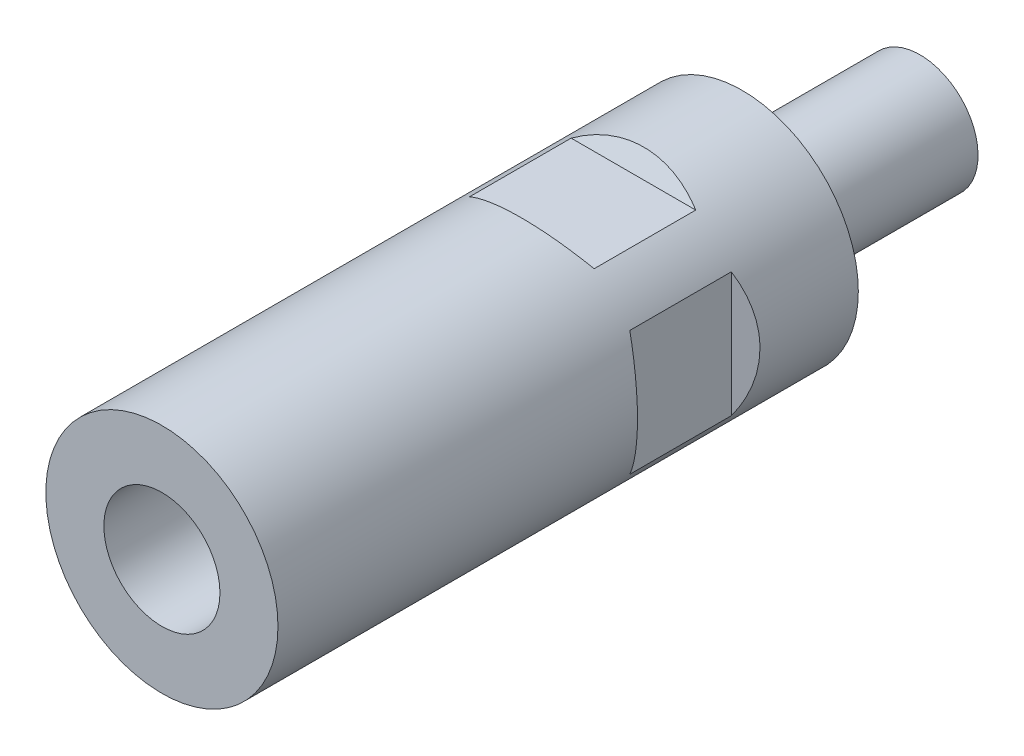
ISO-10303-21;
HEADER;
FILE_DESCRIPTION(('STEP AP214'),'2;1');
FILE_NAME('part.step','',(''),(''),'','','');
FILE_SCHEMA(('AUTOMOTIVE_DESIGN { 1 0 10303 214 1 1 1 1 }'));
ENDSEC;
DATA;
#1=APPLICATION_CONTEXT('core data for automotive mechanical design processes');
#2=APPLICATION_PROTOCOL_DEFINITION('international standard','automotive_design',2000,#1);
#3=PRODUCT_CONTEXT('',#1,'mechanical');
#4=PRODUCT('Part','Part','',(#3));
#5=PRODUCT_RELATED_PRODUCT_CATEGORY('part','',(#4));
#6=PRODUCT_DEFINITION_FORMATION('','',#4);
#7=PRODUCT_DEFINITION_CONTEXT('part definition',#1,'design');
#8=PRODUCT_DEFINITION('design','',#6,#7);
#9=PRODUCT_DEFINITION_SHAPE('','',#8);
#10=(LENGTH_UNIT() NAMED_UNIT(*) SI_UNIT(.MILLI.,.METRE.));
#11=(NAMED_UNIT(*) PLANE_ANGLE_UNIT() SI_UNIT($,.RADIAN.));
#12=(NAMED_UNIT(*) SI_UNIT($,.STERADIAN.) SOLID_ANGLE_UNIT());
#13=UNCERTAINTY_MEASURE_WITH_UNIT(LENGTH_MEASURE(1.E-05),#10,'distance_accuracy_value','');
#14=(GEOMETRIC_REPRESENTATION_CONTEXT(3) GLOBAL_UNCERTAINTY_ASSIGNED_CONTEXT((#13)) GLOBAL_UNIT_ASSIGNED_CONTEXT((#10,
#11,#12)) REPRESENTATION_CONTEXT('',''));
#15=CARTESIAN_POINT('',(0.,0.,0.));
#16=DIRECTION('',(0.,0.,1.));
#17=DIRECTION('',(1.,0.,0.));
#18=AXIS2_PLACEMENT_3D('',#15,#16,#17);
#19=CARTESIAN_POINT('',(0.,0.,0.));
#20=DIRECTION('',(0.,0.,1.));
#21=DIRECTION('',(1.,0.,0.));
#22=AXIS2_PLACEMENT_3D('',#19,#20,#21);
#23=PLANE('',#22);
#24=CARTESIAN_POINT('',(0.,0.,0.));
#25=DIRECTION('',(0.,0.,1.));
#26=DIRECTION('',(1.,0.,0.));
#27=AXIS2_PLACEMENT_3D('',#24,#25,#26);
#28=CIRCLE('',#27,16.);
#29=CARTESIAN_POINT('',(16.,0.,0.));
#30=VERTEX_POINT('',#29);
#31=EDGE_CURVE('E134',#30,#30,#28,.T.);
#32=ORIENTED_EDGE('',*,*,#31,.F.);
#33=EDGE_LOOP('',(#32));
#34=FACE_BOUND('',#33,.T.);
#35=CARTESIAN_POINT('',(0.,0.,0.));
#36=DIRECTION('',(0.,0.,1.));
#37=DIRECTION('',(1.,0.,0.));
#38=AXIS2_PLACEMENT_3D('',#35,#36,#37);
#39=CIRCLE('',#38,8.);
#40=CARTESIAN_POINT('',(8.,0.,0.));
#41=VERTEX_POINT('',#40);
#42=EDGE_CURVE('E9',#41,#41,#39,.F.);
#43=ORIENTED_EDGE('',*,*,#42,.F.);
#44=EDGE_LOOP('',(#43));
#45=FACE_BOUND('',#44,.T.);
#46=ADVANCED_FACE('F14',(#34,#45),#23,.F.);
#47=CARTESIAN_POINT('',(0.,0.,80.));
#48=DIRECTION('',(0.,0.,-1.));
#49=DIRECTION('',(-1.,0.,0.));
#50=AXIS2_PLACEMENT_3D('',#47,#48,#49);
#51=CYLINDRICAL_SURFACE('',#50,16.);
#52=DIRECTION('',(0.,0.,-1.));
#53=VECTOR('',#52,1.);
#54=CARTESIAN_POINT('',(-8.58778201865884,-13.5,80.));
#55=LINE('',#54,#53);
#56=CARTESIAN_POINT('',(-8.58778201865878,-13.5,15.));
#57=VERTEX_POINT('',#56);
#58=CARTESIAN_POINT('',(-8.58778201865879,-13.5,29.));
#59=VERTEX_POINT('',#58);
#60=EDGE_CURVE('E87',#57,#59,#55,.F.);
#61=ORIENTED_EDGE('',*,*,#60,.T.);
#62=CARTESIAN_POINT('',(0.,0.,21.2057713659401));
#63=DIRECTION('',(0.,0.5,0.86602540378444));
#64=DIRECTION('',(0.,0.86602540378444,-0.5));
#65=AXIS2_PLACEMENT_3D('',#62,#63,#64);
#66=ELLIPSE('',#65,18.475208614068,16.);
#67=CARTESIAN_POINT('',(8.58778201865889,-13.5,29.));
#68=VERTEX_POINT('',#67);
#69=EDGE_CURVE('E22',#59,#68,#66,.T.);
#70=ORIENTED_EDGE('',*,*,#69,.T.);
#71=DIRECTION('',(0.,0.,-1.));
#72=VECTOR('',#71,1.);
#73=CARTESIAN_POINT('',(8.58778201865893,-13.5,80.));
#74=LINE('',#73,#72);
#75=CARTESIAN_POINT('',(8.58778201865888,-13.5,15.));
#76=VERTEX_POINT('',#75);
#77=EDGE_CURVE('E93',#68,#76,#74,.T.);
#78=ORIENTED_EDGE('',*,*,#77,.T.);
#79=CARTESIAN_POINT('',(0.,0.,22.7942286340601));
#80=DIRECTION('',(0.,0.5,-0.866025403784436));
#81=DIRECTION('',(0.,-0.866025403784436,-0.5));
#82=AXIS2_PLACEMENT_3D('',#79,#80,#81);
#83=ELLIPSE('',#82,18.4752086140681,16.);
#84=EDGE_CURVE('E79',#76,#57,#83,.T.);
#85=ORIENTED_EDGE('',*,*,#84,.T.);
#86=EDGE_LOOP('',(#61,#70,#78,#85));
#87=FACE_BOUND('',#86,.T.);
#88=CARTESIAN_POINT('',(0.,0.,22.7942286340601));
#89=DIRECTION('',(0.,-0.5,-0.866025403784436));
#90=DIRECTION('',(0.,0.866025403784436,-0.5));
#91=AXIS2_PLACEMENT_3D('',#88,#89,#90);
#92=ELLIPSE('',#91,18.4752086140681,16.);
#93=CARTESIAN_POINT('',(-8.58778201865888,13.5,15.));
#94=VERTEX_POINT('',#93);
#95=CARTESIAN_POINT('',(8.58778201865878,13.5,15.));
#96=VERTEX_POINT('',#95);
#97=EDGE_CURVE('E111',#94,#96,#92,.T.);
#98=ORIENTED_EDGE('',*,*,#97,.T.);
#99=DIRECTION('',(0.,0.,-1.));
#100=VECTOR('',#99,1.);
#101=CARTESIAN_POINT('',(8.5877820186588,13.5,80.));
#102=LINE('',#101,#100);
#103=CARTESIAN_POINT('',(8.5877820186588,13.5,29.));
#104=VERTEX_POINT('',#103);
#105=EDGE_CURVE('E88',#96,#104,#102,.F.);
#106=ORIENTED_EDGE('',*,*,#105,.T.);
#107=CARTESIAN_POINT('',(0.,0.,21.2057713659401));
#108=DIRECTION('',(0.,-0.5,0.86602540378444));
#109=DIRECTION('',(0.,-0.86602540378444,-0.5));
#110=AXIS2_PLACEMENT_3D('',#107,#108,#109);
#111=ELLIPSE('',#110,18.475208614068,16.);
#112=CARTESIAN_POINT('',(-8.5877820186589,13.5,29.));
#113=VERTEX_POINT('',#112);
#114=EDGE_CURVE('E105',#104,#113,#111,.T.);
#115=ORIENTED_EDGE('',*,*,#114,.T.);
#116=DIRECTION('',(0.,0.,-1.));
#117=VECTOR('',#116,1.);
#118=CARTESIAN_POINT('',(-8.5877820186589,13.5,80.));
#119=LINE('',#118,#117);
#120=EDGE_CURVE('E108',#113,#94,#119,.T.);
#121=ORIENTED_EDGE('',*,*,#120,.T.);
#122=EDGE_LOOP('',(#98,#106,#115,#121));
#123=FACE_BOUND('',#122,.T.);
#124=DIRECTION('',(0.,0.,-1.));
#125=VECTOR('',#124,1.);
#126=CARTESIAN_POINT('',(-13.5,8.58778201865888,80.));
#127=LINE('',#126,#125);
#128=CARTESIAN_POINT('',(-13.5,8.58778201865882,15.));
#129=VERTEX_POINT('',#128);
#130=CARTESIAN_POINT('',(-13.5,8.58778201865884,29.));
#131=VERTEX_POINT('',#130);
#132=EDGE_CURVE('E119',#129,#131,#127,.F.);
#133=ORIENTED_EDGE('',*,*,#132,.T.);
#134=CARTESIAN_POINT('',(0.,0.,21.2057713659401));
#135=DIRECTION('',(0.5,0.,0.86602540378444));
#136=DIRECTION('',(0.86602540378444,0.,-0.5));
#137=AXIS2_PLACEMENT_3D('',#134,#135,#136);
#138=ELLIPSE('',#137,18.475208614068,16.);
#139=CARTESIAN_POINT('',(-13.5,-8.58778201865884,29.));
#140=VERTEX_POINT('',#139);
#141=EDGE_CURVE('E113',#131,#140,#138,.T.);
#142=ORIENTED_EDGE('',*,*,#141,.T.);
#143=DIRECTION('',(0.,0.,-1.));
#144=VECTOR('',#143,1.);
#145=CARTESIAN_POINT('',(-13.5,-8.58778201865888,80.));
#146=LINE('',#145,#144);
#147=CARTESIAN_POINT('',(-13.5,-8.58778201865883,15.));
#148=VERTEX_POINT('',#147);
#149=EDGE_CURVE('E116',#140,#148,#146,.T.);
#150=ORIENTED_EDGE('',*,*,#149,.T.);
#151=CARTESIAN_POINT('',(0.,0.,22.7942286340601));
#152=DIRECTION('',(0.5,0.,-0.866025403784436));
#153=DIRECTION('',(-0.866025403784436,0.,-0.5));
#154=AXIS2_PLACEMENT_3D('',#151,#152,#153);
#155=ELLIPSE('',#154,18.4752086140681,16.);
#156=EDGE_CURVE('E122',#148,#129,#155,.T.);
#157=ORIENTED_EDGE('',*,*,#156,.T.);
#158=EDGE_LOOP('',(#133,#142,#150,#157));
#159=FACE_BOUND('',#158,.T.);
#160=CARTESIAN_POINT('',(0.,0.,22.7942286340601));
#161=DIRECTION('',(-0.5,0.,-0.866025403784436));
#162=DIRECTION('',(0.866025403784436,0.,-0.5));
#163=AXIS2_PLACEMENT_3D('',#160,#161,#162);
#164=ELLIPSE('',#163,18.4752086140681,16.);
#165=CARTESIAN_POINT('',(13.5,8.58778201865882,15.));
#166=VERTEX_POINT('',#165);
#167=CARTESIAN_POINT('',(13.5,-8.58778201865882,15.));
#168=VERTEX_POINT('',#167);
#169=EDGE_CURVE('E129',#166,#168,#164,.T.);
#170=ORIENTED_EDGE('',*,*,#169,.T.);
#171=DIRECTION('',(0.,0.,-1.));
#172=VECTOR('',#171,1.);
#173=CARTESIAN_POINT('',(13.5,-8.58778201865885,80.));
#174=LINE('',#173,#172);
#175=CARTESIAN_POINT('',(13.5,-8.58778201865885,29.));
#176=VERTEX_POINT('',#175);
#177=EDGE_CURVE('E124',#168,#176,#174,.F.);
#178=ORIENTED_EDGE('',*,*,#177,.T.);
#179=CARTESIAN_POINT('',(0.,0.,21.2057713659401));
#180=DIRECTION('',(-0.5,0.,0.86602540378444));
#181=DIRECTION('',(-0.86602540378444,0.,-0.5));
#182=AXIS2_PLACEMENT_3D('',#179,#180,#181);
#183=ELLIPSE('',#182,18.475208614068,16.);
#184=CARTESIAN_POINT('',(13.5,8.58778201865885,29.));
#185=VERTEX_POINT('',#184);
#186=EDGE_CURVE('E35',#176,#185,#183,.T.);
#187=ORIENTED_EDGE('',*,*,#186,.T.);
#188=DIRECTION('',(0.,0.,-1.));
#189=VECTOR('',#188,1.);
#190=CARTESIAN_POINT('',(13.5,8.58778201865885,80.));
#191=LINE('',#190,#189);
#192=EDGE_CURVE('E29',#185,#166,#191,.T.);
#193=ORIENTED_EDGE('',*,*,#192,.T.);
#194=EDGE_LOOP('',(#170,#178,#187,#193));
#195=FACE_BOUND('',#194,.T.);
#196=CARTESIAN_POINT('',(0.,0.,80.));
#197=DIRECTION('',(0.,0.,1.));
#198=DIRECTION('',(1.,0.,0.));
#199=AXIS2_PLACEMENT_3D('',#196,#197,#198);
#200=CIRCLE('',#199,16.);
#201=CARTESIAN_POINT('',(16.,0.,80.));
#202=VERTEX_POINT('',#201);
#203=EDGE_CURVE('E131',#202,#202,#200,.T.);
#204=ORIENTED_EDGE('',*,*,#203,.F.);
#205=EDGE_LOOP('',(#204));
#206=FACE_BOUND('',#205,.T.);
#207=ORIENTED_EDGE('',*,*,#31,.T.);
#208=EDGE_LOOP('',(#207));
#209=FACE_BOUND('',#208,.T.);
#210=ADVANCED_FACE('F16',(#87,#123,#159,#195,#206,#209),#51,.T.);
#211=CARTESIAN_POINT('',(0.,0.,80.));
#212=DIRECTION('',(0.,0.,1.));
#213=DIRECTION('',(1.,0.,0.));
#214=AXIS2_PLACEMENT_3D('',#211,#212,#213);
#215=PLANE('',#214);
#216=CARTESIAN_POINT('',(0.,0.,80.));
#217=DIRECTION('',(0.,0.,1.));
#218=DIRECTION('',(1.,0.,0.));
#219=AXIS2_PLACEMENT_3D('',#216,#217,#218);
#220=CIRCLE('',#219,8.);
#221=CARTESIAN_POINT('',(8.,0.,80.));
#222=VERTEX_POINT('',#221);
#223=EDGE_CURVE('E96',#222,#222,#220,.T.);
#224=ORIENTED_EDGE('',*,*,#223,.F.);
#225=EDGE_LOOP('',(#224));
#226=FACE_BOUND('',#225,.T.);
#227=ORIENTED_EDGE('',*,*,#203,.T.);
#228=EDGE_LOOP('',(#227));
#229=FACE_BOUND('',#228,.T.);
#230=ADVANCED_FACE('F179',(#226,#229),#215,.T.);
#231=CARTESIAN_POINT('',(13.5,-16.,29.));
#232=DIRECTION('',(-0.5,0.,0.86602540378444));
#233=DIRECTION('',(0.86602540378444,0.,0.5));
#234=AXIS2_PLACEMENT_3D('',#231,#232,#233);
#235=PLANE('',#234);
#236=DIRECTION('',(0.,1.,0.));
#237=VECTOR('',#236,1.);
#238=CARTESIAN_POINT('',(13.5,-16.,29.));
#239=LINE('',#238,#237);
#240=EDGE_CURVE('E137',#176,#185,#239,.T.);
#241=ORIENTED_EDGE('',*,*,#240,.T.);
#242=ORIENTED_EDGE('',*,*,#186,.F.);
#243=EDGE_LOOP('',(#241,#242));
#244=FACE_BOUND('',#243,.T.);
#245=ADVANCED_FACE('F182',(#244),#235,.F.);
#246=CARTESIAN_POINT('',(13.5,-16.,29.));
#247=DIRECTION('',(-1.,0.,0.));
#248=DIRECTION('',(0.,0.,1.));
#249=AXIS2_PLACEMENT_3D('',#246,#247,#248);
#250=PLANE('',#249);
#251=ORIENTED_EDGE('',*,*,#240,.F.);
#252=ORIENTED_EDGE('',*,*,#177,.F.);
#253=DIRECTION('',(0.,1.,0.));
#254=VECTOR('',#253,1.);
#255=CARTESIAN_POINT('',(13.5,-16.,15.));
#256=LINE('',#255,#254);
#257=EDGE_CURVE('E138',#168,#166,#256,.T.);
#258=ORIENTED_EDGE('',*,*,#257,.T.);
#259=ORIENTED_EDGE('',*,*,#192,.F.);
#260=EDGE_LOOP('',(#251,#252,#258,#259));
#261=FACE_BOUND('',#260,.T.);
#262=ADVANCED_FACE('F189',(#261),#250,.F.);
#263=CARTESIAN_POINT('',(13.5,-16.,15.));
#264=DIRECTION('',(-0.5,0.,-0.866025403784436));
#265=DIRECTION('',(-0.866025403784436,0.,0.5));
#266=AXIS2_PLACEMENT_3D('',#263,#264,#265);
#267=PLANE('',#266);
#268=ORIENTED_EDGE('',*,*,#169,.F.);
#269=ORIENTED_EDGE('',*,*,#257,.F.);
#270=EDGE_LOOP('',(#268,#269));
#271=FACE_BOUND('',#270,.T.);
#272=ADVANCED_FACE('F239',(#271),#267,.F.);
#273=CARTESIAN_POINT('',(-13.5,-16.,29.));
#274=DIRECTION('',(1.,0.,0.));
#275=DIRECTION('',(0.,0.,-1.));
#276=AXIS2_PLACEMENT_3D('',#273,#274,#275);
#277=PLANE('',#276);
#278=DIRECTION('',(0.,1.,0.));
#279=VECTOR('',#278,1.);
#280=CARTESIAN_POINT('',(-13.5,-16.,29.));
#281=LINE('',#280,#279);
#282=EDGE_CURVE('E140',#140,#131,#281,.T.);
#283=ORIENTED_EDGE('',*,*,#282,.T.);
#284=ORIENTED_EDGE('',*,*,#132,.F.);
#285=DIRECTION('',(0.,1.,0.));
#286=VECTOR('',#285,1.);
#287=CARTESIAN_POINT('',(-13.5,-16.,15.));
#288=LINE('',#287,#286);
#289=EDGE_CURVE('E142',#148,#129,#288,.T.);
#290=ORIENTED_EDGE('',*,*,#289,.F.);
#291=ORIENTED_EDGE('',*,*,#149,.F.);
#292=EDGE_LOOP('',(#283,#284,#290,#291));
#293=FACE_BOUND('',#292,.T.);
#294=ADVANCED_FACE('F232',(#293),#277,.F.);
#295=CARTESIAN_POINT('',(-13.5,-16.,29.));
#296=DIRECTION('',(0.5,0.,0.86602540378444));
#297=DIRECTION('',(0.86602540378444,0.,-0.5));
#298=AXIS2_PLACEMENT_3D('',#295,#296,#297);
#299=PLANE('',#298);
#300=ORIENTED_EDGE('',*,*,#282,.F.);
#301=ORIENTED_EDGE('',*,*,#141,.F.);
#302=EDGE_LOOP('',(#300,#301));
#303=FACE_BOUND('',#302,.T.);
#304=ADVANCED_FACE('F229',(#303),#299,.F.);
#305=CARTESIAN_POINT('',(-13.5,-16.,15.));
#306=DIRECTION('',(0.5,0.,-0.866025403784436));
#307=DIRECTION('',(-0.866025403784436,0.,-0.5));
#308=AXIS2_PLACEMENT_3D('',#305,#306,#307);
#309=PLANE('',#308);
#310=ORIENTED_EDGE('',*,*,#156,.F.);
#311=ORIENTED_EDGE('',*,*,#289,.T.);
#312=EDGE_LOOP('',(#310,#311));
#313=FACE_BOUND('',#312,.T.);
#314=ADVANCED_FACE('F227',(#313),#309,.F.);
#315=CARTESIAN_POINT('',(16.,13.5,29.));
#316=DIRECTION('',(0.,-0.5,0.86602540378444));
#317=DIRECTION('',(0.,-0.86602540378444,-0.5));
#318=AXIS2_PLACEMENT_3D('',#315,#316,#317);
#319=PLANE('',#318);
#320=DIRECTION('',(-1.,0.,0.));
#321=VECTOR('',#320,1.);
#322=CARTESIAN_POINT('',(16.,13.5,29.));
#323=LINE('',#322,#321);
#324=EDGE_CURVE('E145',#104,#113,#323,.T.);
#325=ORIENTED_EDGE('',*,*,#324,.T.);
#326=ORIENTED_EDGE('',*,*,#114,.F.);
#327=EDGE_LOOP('',(#325,#326));
#328=FACE_BOUND('',#327,.T.);
#329=ADVANCED_FACE('F220',(#328),#319,.F.);
#330=CARTESIAN_POINT('',(16.,13.5,29.));
#331=DIRECTION('',(0.,-1.,0.));
#332=DIRECTION('',(1.,0.,0.));
#333=AXIS2_PLACEMENT_3D('',#330,#331,#332);
#334=PLANE('',#333);
#335=ORIENTED_EDGE('',*,*,#324,.F.);
#336=ORIENTED_EDGE('',*,*,#105,.F.);
#337=DIRECTION('',(-1.,0.,0.));
#338=VECTOR('',#337,1.);
#339=CARTESIAN_POINT('',(16.,13.5,15.));
#340=LINE('',#339,#338);
#341=EDGE_CURVE('E148',#96,#94,#340,.T.);
#342=ORIENTED_EDGE('',*,*,#341,.T.);
#343=ORIENTED_EDGE('',*,*,#120,.F.);
#344=EDGE_LOOP('',(#335,#336,#342,#343));
#345=FACE_BOUND('',#344,.T.);
#346=ADVANCED_FACE('F217',(#345),#334,.F.);
#347=CARTESIAN_POINT('',(16.,13.5,15.));
#348=DIRECTION('',(0.,-0.5,-0.866025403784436));
#349=DIRECTION('',(0.,0.866025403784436,-0.5));
#350=AXIS2_PLACEMENT_3D('',#347,#348,#349);
#351=PLANE('',#350);
#352=ORIENTED_EDGE('',*,*,#97,.F.);
#353=ORIENTED_EDGE('',*,*,#341,.F.);
#354=EDGE_LOOP('',(#352,#353));
#355=FACE_BOUND('',#354,.T.);
#356=ADVANCED_FACE('F216',(#355),#351,.F.);
#357=CARTESIAN_POINT('',(16.,-13.5,29.));
#358=DIRECTION('',(0.,1.,0.));
#359=DIRECTION('',(-1.,0.,0.));
#360=AXIS2_PLACEMENT_3D('',#357,#358,#359);
#361=PLANE('',#360);
#362=DIRECTION('',(-1.,0.,0.));
#363=VECTOR('',#362,1.);
#364=CARTESIAN_POINT('',(16.,-13.5,29.));
#365=LINE('',#364,#363);
#366=EDGE_CURVE('E95',#68,#59,#365,.T.);
#367=ORIENTED_EDGE('',*,*,#366,.T.);
#368=ORIENTED_EDGE('',*,*,#60,.F.);
#369=DIRECTION('',(-1.,0.,0.));
#370=VECTOR('',#369,1.);
#371=CARTESIAN_POINT('',(16.,-13.5,15.));
#372=LINE('',#371,#370);
#373=EDGE_CURVE('E82',#76,#57,#372,.T.);
#374=ORIENTED_EDGE('',*,*,#373,.F.);
#375=ORIENTED_EDGE('',*,*,#77,.F.);
#376=EDGE_LOOP('',(#367,#368,#374,#375));
#377=FACE_BOUND('',#376,.T.);
#378=ADVANCED_FACE('F92',(#377),#361,.F.);
#379=CARTESIAN_POINT('',(16.,-13.5,29.));
#380=DIRECTION('',(0.,0.5,0.86602540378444));
#381=DIRECTION('',(0.,-0.86602540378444,0.5));
#382=AXIS2_PLACEMENT_3D('',#379,#380,#381);
#383=PLANE('',#382);
#384=ORIENTED_EDGE('',*,*,#366,.F.);
#385=ORIENTED_EDGE('',*,*,#69,.F.);
#386=EDGE_LOOP('',(#384,#385));
#387=FACE_BOUND('',#386,.T.);
#388=ADVANCED_FACE('F206',(#387),#383,.F.);
#389=CARTESIAN_POINT('',(16.,-13.5,15.));
#390=DIRECTION('',(0.,0.5,-0.866025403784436));
#391=DIRECTION('',(0.,0.866025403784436,0.5));
#392=AXIS2_PLACEMENT_3D('',#389,#390,#391);
#393=PLANE('',#392);
#394=ORIENTED_EDGE('',*,*,#84,.F.);
#395=ORIENTED_EDGE('',*,*,#373,.T.);
#396=EDGE_LOOP('',(#394,#395));
#397=FACE_BOUND('',#396,.T.);
#398=ADVANCED_FACE('F81',(#397),#393,.F.);
#399=CARTESIAN_POINT('',(0.,0.,80.));
#400=DIRECTION('',(0.,0.,1.));
#401=DIRECTION('',(1.,0.,0.));
#402=AXIS2_PLACEMENT_3D('',#399,#400,#401);
#403=CYLINDRICAL_SURFACE('',#402,8.);
#404=CARTESIAN_POINT('',(0.,0.,40.));
#405=DIRECTION('',(0.,0.,1.));
#406=DIRECTION('',(1.,0.,0.));
#407=AXIS2_PLACEMENT_3D('',#404,#405,#406);
#408=CIRCLE('',#407,8.);
#409=CARTESIAN_POINT('',(8.,0.,40.));
#410=VERTEX_POINT('',#409);
#411=EDGE_CURVE('E156',#410,#410,#408,.T.);
#412=ORIENTED_EDGE('',*,*,#411,.F.);
#413=EDGE_LOOP('',(#412));
#414=FACE_BOUND('',#413,.T.);
#415=ORIENTED_EDGE('',*,*,#223,.T.);
#416=EDGE_LOOP('',(#415));
#417=FACE_BOUND('',#416,.T.);
#418=ADVANCED_FACE('F196',(#414,#417),#403,.F.);
#419=CARTESIAN_POINT('',(8.,0.,40.));
#420=DIRECTION('',(0.,0.,-1.));
#421=DIRECTION('',(-1.,0.,0.));
#422=AXIS2_PLACEMENT_3D('',#419,#420,#421);
#423=PLANE('',#422);
#424=ORIENTED_EDGE('',*,*,#411,.T.);
#425=EDGE_LOOP('',(#424));
#426=FACE_BOUND('',#425,.T.);
#427=ADVANCED_FACE('F168',(#426),#423,.F.);
#428=CARTESIAN_POINT('',(0.,0.,-4.5));
#429=DIRECTION('',(0.,0.,1.));
#430=DIRECTION('',(0.,-1.,0.));
#431=AXIS2_PLACEMENT_3D('',#428,#429,#430);
#432=CYLINDRICAL_SURFACE('',#431,8.);
#433=CARTESIAN_POINT('',(0.,0.,-24.5));
#434=DIRECTION('',(0.,0.,1.));
#435=DIRECTION('',(0.,-1.,0.));
#436=AXIS2_PLACEMENT_3D('',#433,#434,#435);
#437=CIRCLE('',#436,8.);
#438=CARTESIAN_POINT('',(0.,-8.,-24.5));
#439=VERTEX_POINT('',#438);
#440=EDGE_CURVE('E159',#439,#439,#437,.F.);
#441=ORIENTED_EDGE('',*,*,#440,.F.);
#442=EDGE_LOOP('',(#441));
#443=FACE_BOUND('',#442,.T.);
#444=ORIENTED_EDGE('',*,*,#42,.T.);
#445=EDGE_LOOP('',(#444));
#446=FACE_BOUND('',#445,.T.);
#447=ADVANCED_FACE('F165',(#443,#446),#432,.T.);
#448=CARTESIAN_POINT('',(0.,0.,-24.5));
#449=DIRECTION('',(0.,0.,1.));
#450=DIRECTION('',(0.,-1.,0.));
#451=AXIS2_PLACEMENT_3D('',#448,#449,#450);
#452=PLANE('',#451);
#453=ORIENTED_EDGE('',*,*,#440,.T.);
#454=EDGE_LOOP('',(#453));
#455=FACE_BOUND('',#454,.T.);
#456=ADVANCED_FACE('F163',(#455),#452,.F.);
#457=CLOSED_SHELL('',(#46,#210,#230,#245,#262,#272,#294,#304,#314,#329,#346,#356,#378,#388,#398,
#418,#427,#447,#456));
#458=MANIFOLD_SOLID_BREP('B1',#457);
#459=ADVANCED_BREP_SHAPE_REPRESENTATION('',(#18,#458),#14);
#460=SHAPE_DEFINITION_REPRESENTATION(#9,#459);
ENDSEC;
END-ISO-10303-21;
